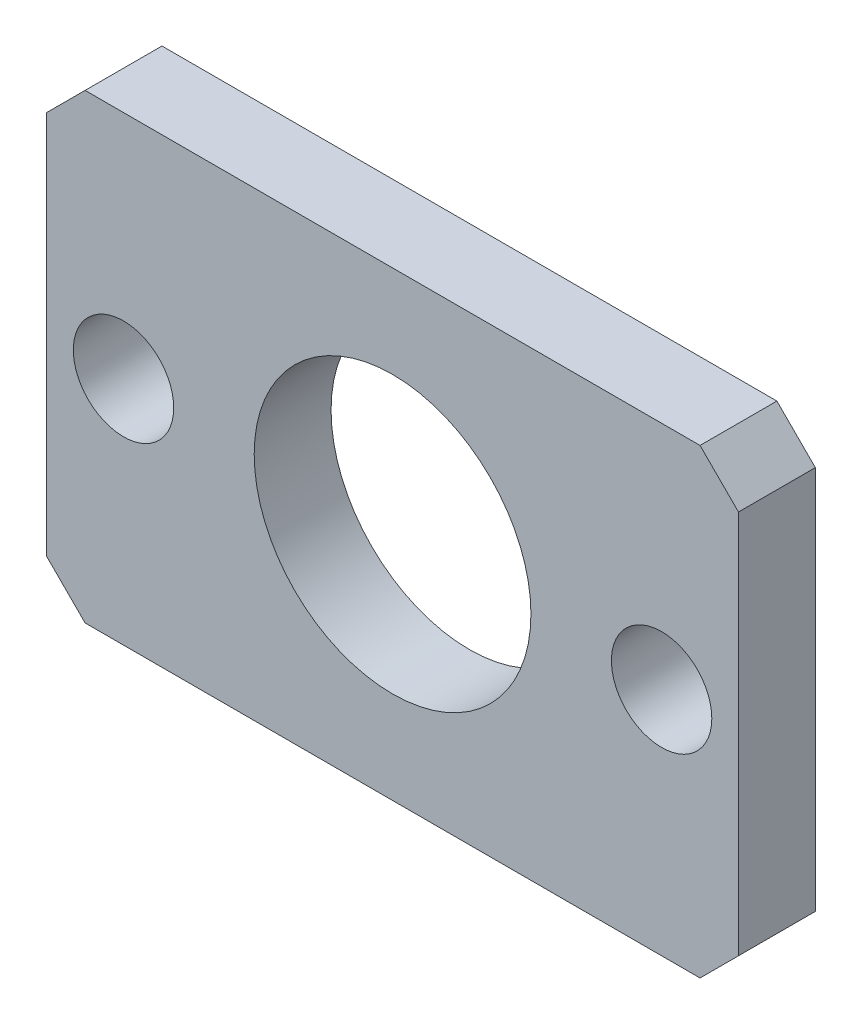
ISO-10303-21;
HEADER;
FILE_DESCRIPTION(('STEP AP214'),'2;1');
FILE_NAME('part.step','',(''),(''),'','','');
FILE_SCHEMA(('AUTOMOTIVE_DESIGN { 1 0 10303 214 1 1 1 1 }'));
ENDSEC;
DATA;
#1=APPLICATION_CONTEXT('core data for automotive mechanical design processes');
#2=APPLICATION_PROTOCOL_DEFINITION('international standard','automotive_design',2000,#1);
#3=PRODUCT_CONTEXT('',#1,'mechanical');
#4=PRODUCT('Part','Part','',(#3));
#5=PRODUCT_RELATED_PRODUCT_CATEGORY('part','',(#4));
#6=PRODUCT_DEFINITION_FORMATION('','',#4);
#7=PRODUCT_DEFINITION_CONTEXT('part definition',#1,'design');
#8=PRODUCT_DEFINITION('design','',#6,#7);
#9=PRODUCT_DEFINITION_SHAPE('','',#8);
#10=(LENGTH_UNIT() NAMED_UNIT(*) SI_UNIT(.MILLI.,.METRE.));
#11=(NAMED_UNIT(*) PLANE_ANGLE_UNIT() SI_UNIT($,.RADIAN.));
#12=(NAMED_UNIT(*) SI_UNIT($,.STERADIAN.) SOLID_ANGLE_UNIT());
#13=UNCERTAINTY_MEASURE_WITH_UNIT(LENGTH_MEASURE(1.E-05),#10,'distance_accuracy_value','');
#14=(GEOMETRIC_REPRESENTATION_CONTEXT(3) GLOBAL_UNCERTAINTY_ASSIGNED_CONTEXT((#13)) GLOBAL_UNIT_ASSIGNED_CONTEXT((#10,
#11,#12)) REPRESENTATION_CONTEXT('',''));
#15=CARTESIAN_POINT('',(0.,0.,0.));
#16=DIRECTION('',(0.,0.,1.));
#17=DIRECTION('',(1.,0.,0.));
#18=AXIS2_PLACEMENT_3D('',#15,#16,#17);
#19=CARTESIAN_POINT('',(-22.5,15.,5.));
#20=DIRECTION('',(1.,0.,0.));
#21=DIRECTION('',(0.,1.,0.));
#22=AXIS2_PLACEMENT_3D('',#19,#20,#21);
#23=PLANE('',#22);
#24=DIRECTION('',(0.,-1.,0.));
#25=VECTOR('',#24,1.);
#26=CARTESIAN_POINT('',(-22.5,15.,0.));
#27=LINE('',#26,#25);
#28=CARTESIAN_POINT('',(-22.5,12.5,0.));
#29=VERTEX_POINT('',#28);
#30=CARTESIAN_POINT('',(-22.5,-12.5,0.));
#31=VERTEX_POINT('',#30);
#32=EDGE_CURVE('E123',#29,#31,#27,.T.);
#33=ORIENTED_EDGE('',*,*,#32,.T.);
#34=DIRECTION('',(0.,0.,1.));
#35=VECTOR('',#34,1.);
#36=CARTESIAN_POINT('',(-22.5,-12.5,5.));
#37=LINE('',#36,#35);
#38=CARTESIAN_POINT('',(-22.5,-12.5,5.));
#39=VERTEX_POINT('',#38);
#40=EDGE_CURVE('E11',#31,#39,#37,.T.);
#41=ORIENTED_EDGE('',*,*,#40,.T.);
#42=DIRECTION('',(0.,-1.,0.));
#43=VECTOR('',#42,1.);
#44=CARTESIAN_POINT('',(-22.5,15.,5.));
#45=LINE('',#44,#43);
#46=CARTESIAN_POINT('',(-22.5,12.5,5.));
#47=VERTEX_POINT('',#46);
#48=EDGE_CURVE('E121',#47,#39,#45,.T.);
#49=ORIENTED_EDGE('',*,*,#48,.F.);
#50=DIRECTION('',(0.,0.,-1.));
#51=VECTOR('',#50,1.);
#52=CARTESIAN_POINT('',(-22.5,12.5,5.));
#53=LINE('',#52,#51);
#54=EDGE_CURVE('E35',#47,#29,#53,.T.);
#55=ORIENTED_EDGE('',*,*,#54,.T.);
#56=EDGE_LOOP('',(#33,#41,#49,#55));
#57=FACE_BOUND('',#56,.T.);
#58=ADVANCED_FACE('F28',(#57),#23,.F.);
#59=CARTESIAN_POINT('',(-22.5,-15.,5.));
#60=DIRECTION('',(0.,1.,0.));
#61=DIRECTION('',(0.,0.,1.));
#62=AXIS2_PLACEMENT_3D('',#59,#60,#61);
#63=PLANE('',#62);
#64=DIRECTION('',(1.,0.,0.));
#65=VECTOR('',#64,1.);
#66=CARTESIAN_POINT('',(-22.5,-15.,0.));
#67=LINE('',#66,#65);
#68=CARTESIAN_POINT('',(-20.,-15.,0.));
#69=VERTEX_POINT('',#68);
#70=CARTESIAN_POINT('',(20.,-15.,0.));
#71=VERTEX_POINT('',#70);
#72=EDGE_CURVE('E119',#69,#71,#67,.T.);
#73=ORIENTED_EDGE('',*,*,#72,.T.);
#74=DIRECTION('',(0.,0.,1.));
#75=VECTOR('',#74,1.);
#76=CARTESIAN_POINT('',(20.,-15.,5.));
#77=LINE('',#76,#75);
#78=CARTESIAN_POINT('',(20.,-15.,5.));
#79=VERTEX_POINT('',#78);
#80=EDGE_CURVE('E98',#71,#79,#77,.T.);
#81=ORIENTED_EDGE('',*,*,#80,.T.);
#82=DIRECTION('',(1.,0.,0.));
#83=VECTOR('',#82,1.);
#84=CARTESIAN_POINT('',(-22.5,-15.,5.));
#85=LINE('',#84,#83);
#86=CARTESIAN_POINT('',(-20.,-15.,5.));
#87=VERTEX_POINT('',#86);
#88=EDGE_CURVE('E129',#87,#79,#85,.T.);
#89=ORIENTED_EDGE('',*,*,#88,.F.);
#90=DIRECTION('',(0.,0.,-1.));
#91=VECTOR('',#90,1.);
#92=CARTESIAN_POINT('',(-20.,-15.,5.));
#93=LINE('',#92,#91);
#94=EDGE_CURVE('E103',#87,#69,#93,.T.);
#95=ORIENTED_EDGE('',*,*,#94,.T.);
#96=EDGE_LOOP('',(#73,#81,#89,#95));
#97=FACE_BOUND('',#96,.T.);
#98=ADVANCED_FACE('F196',(#97),#63,.F.);
#99=CARTESIAN_POINT('',(22.5,15.,5.));
#100=DIRECTION('',(-1.,0.,0.));
#101=DIRECTION('',(0.,-1.,0.));
#102=AXIS2_PLACEMENT_3D('',#99,#100,#101);
#103=PLANE('',#102);
#104=DIRECTION('',(0.,1.,0.));
#105=VECTOR('',#104,1.);
#106=CARTESIAN_POINT('',(22.5,15.,5.));
#107=LINE('',#106,#105);
#108=CARTESIAN_POINT('',(22.5,-12.5,5.));
#109=VERTEX_POINT('',#108);
#110=CARTESIAN_POINT('',(22.5,12.5,5.));
#111=VERTEX_POINT('',#110);
#112=EDGE_CURVE('E112',#109,#111,#107,.T.);
#113=ORIENTED_EDGE('',*,*,#112,.F.);
#114=DIRECTION('',(0.,0.,-1.));
#115=VECTOR('',#114,1.);
#116=CARTESIAN_POINT('',(22.5,-12.5,5.));
#117=LINE('',#116,#115);
#118=CARTESIAN_POINT('',(22.5,-12.5,0.));
#119=VERTEX_POINT('',#118);
#120=EDGE_CURVE('E97',#109,#119,#117,.T.);
#121=ORIENTED_EDGE('',*,*,#120,.T.);
#122=DIRECTION('',(0.,1.,0.));
#123=VECTOR('',#122,1.);
#124=CARTESIAN_POINT('',(22.5,15.,0.));
#125=LINE('',#124,#123);
#126=CARTESIAN_POINT('',(22.5,12.5,0.));
#127=VERTEX_POINT('',#126);
#128=EDGE_CURVE('E110',#119,#127,#125,.T.);
#129=ORIENTED_EDGE('',*,*,#128,.T.);
#130=DIRECTION('',(0.,0.,1.));
#131=VECTOR('',#130,1.);
#132=CARTESIAN_POINT('',(22.5,12.5,5.));
#133=LINE('',#132,#131);
#134=EDGE_CURVE('E114',#127,#111,#133,.T.);
#135=ORIENTED_EDGE('',*,*,#134,.T.);
#136=EDGE_LOOP('',(#113,#121,#129,#135));
#137=FACE_BOUND('',#136,.T.);
#138=ADVANCED_FACE('F109',(#137),#103,.F.);
#139=CARTESIAN_POINT('',(-22.5,15.,5.));
#140=DIRECTION('',(0.,-1.,0.));
#141=DIRECTION('',(1.,0.,0.));
#142=AXIS2_PLACEMENT_3D('',#139,#140,#141);
#143=PLANE('',#142);
#144=DIRECTION('',(-1.,0.,0.));
#145=VECTOR('',#144,1.);
#146=CARTESIAN_POINT('',(-22.5,15.,5.));
#147=LINE('',#146,#145);
#148=CARTESIAN_POINT('',(20.,15.,5.));
#149=VERTEX_POINT('',#148);
#150=CARTESIAN_POINT('',(-20.,15.,5.));
#151=VERTEX_POINT('',#150);
#152=EDGE_CURVE('E133',#149,#151,#147,.T.);
#153=ORIENTED_EDGE('',*,*,#152,.F.);
#154=DIRECTION('',(0.,0.,-1.));
#155=VECTOR('',#154,1.);
#156=CARTESIAN_POINT('',(20.,15.,5.));
#157=LINE('',#156,#155);
#158=CARTESIAN_POINT('',(20.,15.,0.));
#159=VERTEX_POINT('',#158);
#160=EDGE_CURVE('E151',#149,#159,#157,.T.);
#161=ORIENTED_EDGE('',*,*,#160,.T.);
#162=DIRECTION('',(-1.,0.,0.));
#163=VECTOR('',#162,1.);
#164=CARTESIAN_POINT('',(-22.5,15.,0.));
#165=LINE('',#164,#163);
#166=CARTESIAN_POINT('',(-20.,15.,0.));
#167=VERTEX_POINT('',#166);
#168=EDGE_CURVE('E118',#159,#167,#165,.T.);
#169=ORIENTED_EDGE('',*,*,#168,.T.);
#170=DIRECTION('',(0.,0.,1.));
#171=VECTOR('',#170,1.);
#172=CARTESIAN_POINT('',(-20.,15.,5.));
#173=LINE('',#172,#171);
#174=EDGE_CURVE('E42',#167,#151,#173,.T.);
#175=ORIENTED_EDGE('',*,*,#174,.T.);
#176=EDGE_LOOP('',(#153,#161,#169,#175));
#177=FACE_BOUND('',#176,.T.);
#178=ADVANCED_FACE('F187',(#177),#143,.F.);
#179=CARTESIAN_POINT('',(-22.5,-15.,5.));
#180=DIRECTION('',(0.,0.,1.));
#181=DIRECTION('',(1.,0.,0.));
#182=AXIS2_PLACEMENT_3D('',#179,#180,#181);
#183=PLANE('',#182);
#184=CARTESIAN_POINT('',(-17.5,0.,5.));
#185=DIRECTION('',(0.,0.,1.));
#186=DIRECTION('',(1.,0.,0.));
#187=AXIS2_PLACEMENT_3D('',#184,#185,#186);
#188=CIRCLE('',#187,3.265);
#189=CARTESIAN_POINT('',(-14.235,0.,5.));
#190=VERTEX_POINT('',#189);
#191=EDGE_CURVE('E178',#190,#190,#188,.T.);
#192=ORIENTED_EDGE('',*,*,#191,.F.);
#193=EDGE_LOOP('',(#192));
#194=FACE_BOUND('',#193,.T.);
#195=CARTESIAN_POINT('',(17.5,0.,5.));
#196=DIRECTION('',(0.,0.,1.));
#197=DIRECTION('',(1.,0.,0.));
#198=AXIS2_PLACEMENT_3D('',#195,#196,#197);
#199=CIRCLE('',#198,3.265);
#200=CARTESIAN_POINT('',(20.765,0.,5.));
#201=VERTEX_POINT('',#200);
#202=EDGE_CURVE('E172',#201,#201,#199,.T.);
#203=ORIENTED_EDGE('',*,*,#202,.F.);
#204=EDGE_LOOP('',(#203));
#205=FACE_BOUND('',#204,.T.);
#206=CARTESIAN_POINT('',(0.,0.,5.));
#207=DIRECTION('',(0.,0.,1.));
#208=DIRECTION('',(1.,0.,0.));
#209=AXIS2_PLACEMENT_3D('',#206,#207,#208);
#210=CIRCLE('',#209,9.);
#211=CARTESIAN_POINT('',(9.,0.,5.));
#212=VERTEX_POINT('',#211);
#213=EDGE_CURVE('E164',#212,#212,#210,.T.);
#214=ORIENTED_EDGE('',*,*,#213,.F.);
#215=EDGE_LOOP('',(#214));
#216=FACE_BOUND('',#215,.T.);
#217=ORIENTED_EDGE('',*,*,#88,.T.);
#218=DIRECTION('',(-0.70710678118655,-0.707106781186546,0.));
#219=VECTOR('',#218,1.);
#220=CARTESIAN_POINT('',(-1.25000000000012,-36.25,5.));
#221=LINE('',#220,#219);
#222=EDGE_CURVE('E148',#79,#109,#221,.F.);
#223=ORIENTED_EDGE('',*,*,#222,.T.);
#224=ORIENTED_EDGE('',*,*,#112,.T.);
#225=DIRECTION('',(0.707106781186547,-0.707106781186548,0.));
#226=VECTOR('',#225,1.);
#227=CARTESIAN_POINT('',(13.75,21.25,5.));
#228=LINE('',#227,#226);
#229=EDGE_CURVE('E49',#111,#149,#228,.F.);
#230=ORIENTED_EDGE('',*,*,#229,.T.);
#231=ORIENTED_EDGE('',*,*,#152,.T.);
#232=DIRECTION('',(0.707106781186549,0.707106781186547,0.));
#233=VECTOR('',#232,1.);
#234=CARTESIAN_POINT('',(-36.25,-1.24999999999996,5.));
#235=LINE('',#234,#233);
#236=EDGE_CURVE('E143',#151,#47,#235,.F.);
#237=ORIENTED_EDGE('',*,*,#236,.T.);
#238=ORIENTED_EDGE('',*,*,#48,.T.);
#239=DIRECTION('',(-0.707106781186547,0.707106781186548,0.));
#240=VECTOR('',#239,1.);
#241=CARTESIAN_POINT('',(-21.25,-13.75,5.));
#242=LINE('',#241,#240);
#243=EDGE_CURVE('E145',#39,#87,#242,.F.);
#244=ORIENTED_EDGE('',*,*,#243,.T.);
#245=EDGE_LOOP('',(#217,#223,#224,#230,#231,#237,#238,#244));
#246=FACE_BOUND('',#245,.T.);
#247=ADVANCED_FACE('F184',(#194,#205,#216,#246),#183,.T.);
#248=CARTESIAN_POINT('',(-22.5,-15.,0.));
#249=DIRECTION('',(0.,0.,1.));
#250=DIRECTION('',(1.,0.,0.));
#251=AXIS2_PLACEMENT_3D('',#248,#249,#250);
#252=PLANE('',#251);
#253=CARTESIAN_POINT('',(-17.5,0.,0.));
#254=DIRECTION('',(0.,0.,1.));
#255=DIRECTION('',(1.,0.,0.));
#256=AXIS2_PLACEMENT_3D('',#253,#254,#255);
#257=CIRCLE('',#256,3.265);
#258=CARTESIAN_POINT('',(-14.235,0.,0.));
#259=VERTEX_POINT('',#258);
#260=EDGE_CURVE('E175',#259,#259,#257,.T.);
#261=ORIENTED_EDGE('',*,*,#260,.T.);
#262=EDGE_LOOP('',(#261));
#263=FACE_BOUND('',#262,.T.);
#264=CARTESIAN_POINT('',(17.5,0.,0.));
#265=DIRECTION('',(0.,0.,1.));
#266=DIRECTION('',(1.,0.,0.));
#267=AXIS2_PLACEMENT_3D('',#264,#265,#266);
#268=CIRCLE('',#267,3.265);
#269=CARTESIAN_POINT('',(20.765,0.,0.));
#270=VERTEX_POINT('',#269);
#271=EDGE_CURVE('E169',#270,#270,#268,.T.);
#272=ORIENTED_EDGE('',*,*,#271,.T.);
#273=EDGE_LOOP('',(#272));
#274=FACE_BOUND('',#273,.T.);
#275=CARTESIAN_POINT('',(0.,0.,0.));
#276=DIRECTION('',(0.,0.,1.));
#277=DIRECTION('',(1.,0.,0.));
#278=AXIS2_PLACEMENT_3D('',#275,#276,#277);
#279=CIRCLE('',#278,9.);
#280=CARTESIAN_POINT('',(9.,0.,0.));
#281=VERTEX_POINT('',#280);
#282=EDGE_CURVE('E162',#281,#281,#279,.T.);
#283=ORIENTED_EDGE('',*,*,#282,.T.);
#284=EDGE_LOOP('',(#283));
#285=FACE_BOUND('',#284,.T.);
#286=ORIENTED_EDGE('',*,*,#128,.F.);
#287=DIRECTION('',(0.70710678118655,0.707106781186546,0.));
#288=VECTOR('',#287,1.);
#289=CARTESIAN_POINT('',(22.5,-12.5,0.));
#290=LINE('',#289,#288);
#291=EDGE_CURVE('E93',#119,#71,#290,.F.);
#292=ORIENTED_EDGE('',*,*,#291,.T.);
#293=ORIENTED_EDGE('',*,*,#72,.F.);
#294=DIRECTION('',(0.707106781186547,-0.707106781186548,0.));
#295=VECTOR('',#294,1.);
#296=CARTESIAN_POINT('',(-20.,-15.,0.));
#297=LINE('',#296,#295);
#298=EDGE_CURVE('E137',#69,#31,#297,.F.);
#299=ORIENTED_EDGE('',*,*,#298,.T.);
#300=ORIENTED_EDGE('',*,*,#32,.F.);
#301=DIRECTION('',(-0.707106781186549,-0.707106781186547,0.));
#302=VECTOR('',#301,1.);
#303=CARTESIAN_POINT('',(-22.5,12.5,0.));
#304=LINE('',#303,#302);
#305=EDGE_CURVE('E113',#29,#167,#304,.F.);
#306=ORIENTED_EDGE('',*,*,#305,.T.);
#307=ORIENTED_EDGE('',*,*,#168,.F.);
#308=DIRECTION('',(-0.707106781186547,0.707106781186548,0.));
#309=VECTOR('',#308,1.);
#310=CARTESIAN_POINT('',(20.,15.,0.));
#311=LINE('',#310,#309);
#312=EDGE_CURVE('E104',#159,#127,#311,.F.);
#313=ORIENTED_EDGE('',*,*,#312,.T.);
#314=EDGE_LOOP('',(#286,#292,#293,#299,#300,#306,#307,#313));
#315=FACE_BOUND('',#314,.T.);
#316=ADVANCED_FACE('F116',(#263,#274,#285,#315),#252,.F.);
#317=CARTESIAN_POINT('',(22.5,-12.5,5.));
#318=DIRECTION('',(-0.707106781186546,0.70710678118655,0.));
#319=DIRECTION('',(-0.70710678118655,-0.707106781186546,0.));
#320=AXIS2_PLACEMENT_3D('',#317,#318,#319);
#321=PLANE('',#320);
#322=ORIENTED_EDGE('',*,*,#222,.F.);
#323=ORIENTED_EDGE('',*,*,#80,.F.);
#324=ORIENTED_EDGE('',*,*,#291,.F.);
#325=ORIENTED_EDGE('',*,*,#120,.F.);
#326=EDGE_LOOP('',(#322,#323,#324,#325));
#327=FACE_BOUND('',#326,.T.);
#328=ADVANCED_FACE('F96',(#327),#321,.F.);
#329=CARTESIAN_POINT('',(20.,15.,5.));
#330=DIRECTION('',(-0.707106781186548,-0.707106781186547,0.));
#331=DIRECTION('',(0.707106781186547,-0.707106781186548,0.));
#332=AXIS2_PLACEMENT_3D('',#329,#330,#331);
#333=PLANE('',#332);
#334=ORIENTED_EDGE('',*,*,#229,.F.);
#335=ORIENTED_EDGE('',*,*,#134,.F.);
#336=ORIENTED_EDGE('',*,*,#312,.F.);
#337=ORIENTED_EDGE('',*,*,#160,.F.);
#338=EDGE_LOOP('',(#334,#335,#336,#337));
#339=FACE_BOUND('',#338,.T.);
#340=ADVANCED_FACE('F210',(#339),#333,.F.);
#341=CARTESIAN_POINT('',(-20.,-15.,5.));
#342=DIRECTION('',(0.707106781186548,0.707106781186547,0.));
#343=DIRECTION('',(-0.707106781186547,0.707106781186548,0.));
#344=AXIS2_PLACEMENT_3D('',#341,#342,#343);
#345=PLANE('',#344);
#346=ORIENTED_EDGE('',*,*,#243,.F.);
#347=ORIENTED_EDGE('',*,*,#40,.F.);
#348=ORIENTED_EDGE('',*,*,#298,.F.);
#349=ORIENTED_EDGE('',*,*,#94,.F.);
#350=EDGE_LOOP('',(#346,#347,#348,#349));
#351=FACE_BOUND('',#350,.T.);
#352=ADVANCED_FACE('F198',(#351),#345,.F.);
#353=CARTESIAN_POINT('',(-22.5,12.5,5.));
#354=DIRECTION('',(0.707106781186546,-0.707106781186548,0.));
#355=DIRECTION('',(0.707106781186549,0.707106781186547,0.));
#356=AXIS2_PLACEMENT_3D('',#353,#354,#355);
#357=PLANE('',#356);
#358=ORIENTED_EDGE('',*,*,#236,.F.);
#359=ORIENTED_EDGE('',*,*,#174,.F.);
#360=ORIENTED_EDGE('',*,*,#305,.F.);
#361=ORIENTED_EDGE('',*,*,#54,.F.);
#362=EDGE_LOOP('',(#358,#359,#360,#361));
#363=FACE_BOUND('',#362,.T.);
#364=ADVANCED_FACE('F199',(#363),#357,.F.);
#365=CARTESIAN_POINT('',(0.,0.,0.));
#366=DIRECTION('',(0.,0.,1.));
#367=DIRECTION('',(1.,0.,0.));
#368=AXIS2_PLACEMENT_3D('',#365,#366,#367);
#369=CYLINDRICAL_SURFACE('',#368,9.);
#370=ORIENTED_EDGE('',*,*,#282,.F.);
#371=EDGE_LOOP('',(#370));
#372=FACE_BOUND('',#371,.T.);
#373=ORIENTED_EDGE('',*,*,#213,.T.);
#374=EDGE_LOOP('',(#373));
#375=FACE_BOUND('',#374,.T.);
#376=ADVANCED_FACE('F201',(#372,#375),#369,.F.);
#377=CARTESIAN_POINT('',(17.5,0.,0.));
#378=DIRECTION('',(0.,0.,1.));
#379=DIRECTION('',(1.,0.,0.));
#380=AXIS2_PLACEMENT_3D('',#377,#378,#379);
#381=CYLINDRICAL_SURFACE('',#380,3.265);
#382=ORIENTED_EDGE('',*,*,#271,.F.);
#383=EDGE_LOOP('',(#382));
#384=FACE_BOUND('',#383,.T.);
#385=ORIENTED_EDGE('',*,*,#202,.T.);
#386=EDGE_LOOP('',(#385));
#387=FACE_BOUND('',#386,.T.);
#388=ADVANCED_FACE('F207',(#384,#387),#381,.F.);
#389=CARTESIAN_POINT('',(-17.5,0.,0.));
#390=DIRECTION('',(0.,0.,1.));
#391=DIRECTION('',(1.,0.,0.));
#392=AXIS2_PLACEMENT_3D('',#389,#390,#391);
#393=CYLINDRICAL_SURFACE('',#392,3.265);
#394=ORIENTED_EDGE('',*,*,#260,.F.);
#395=EDGE_LOOP('',(#394));
#396=FACE_BOUND('',#395,.T.);
#397=ORIENTED_EDGE('',*,*,#191,.T.);
#398=EDGE_LOOP('',(#397));
#399=FACE_BOUND('',#398,.T.);
#400=ADVANCED_FACE('F182',(#396,#399),#393,.F.);
#401=CLOSED_SHELL('',(#58,#98,#138,#178,#247,#316,#328,#340,#352,#364,#376,#388,#400));
#402=MANIFOLD_SOLID_BREP('B2',#401);
#403=ADVANCED_BREP_SHAPE_REPRESENTATION('',(#18,#402),#14);
#404=SHAPE_DEFINITION_REPRESENTATION(#9,#403);
ENDSEC;
END-ISO-10303-21;
